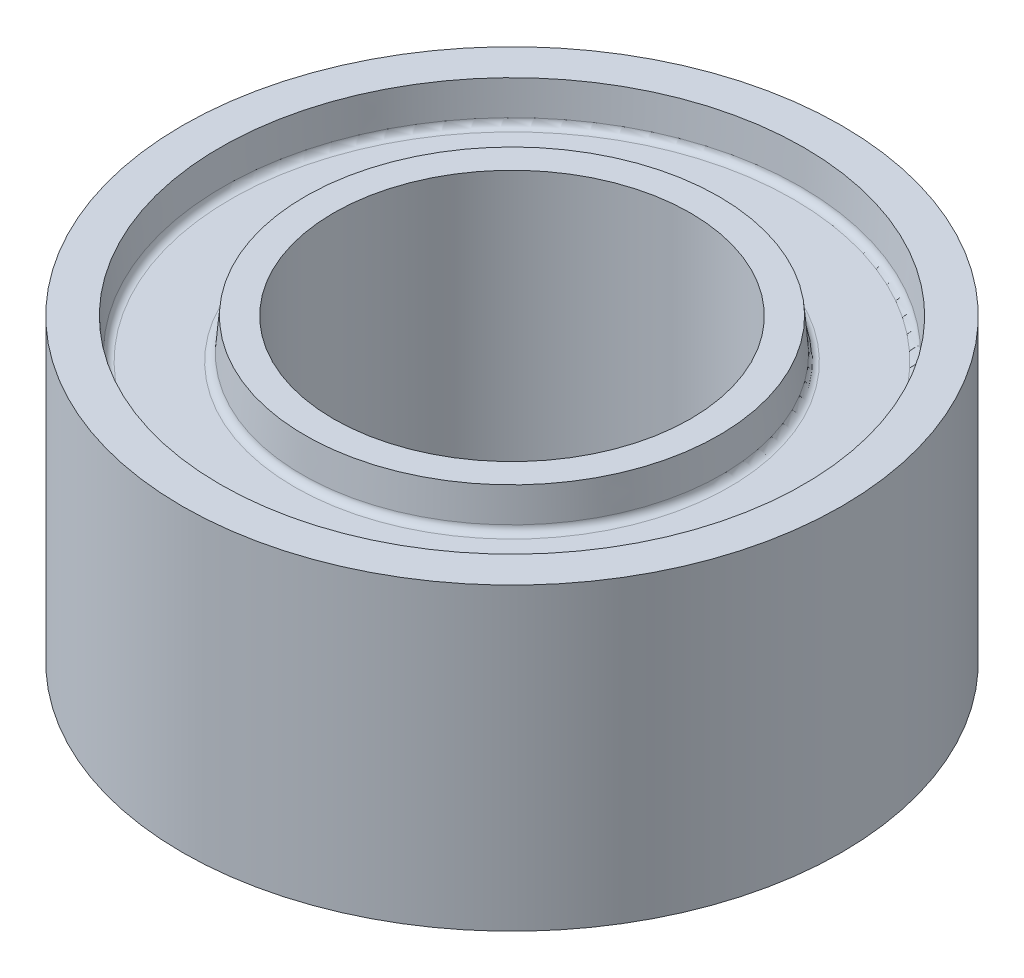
ISO-10303-21;
HEADER;
FILE_DESCRIPTION(('STEP AP214'),'2;1');
FILE_NAME('part.step','',(''),(''),'','','');
FILE_SCHEMA(('AUTOMOTIVE_DESIGN { 1 0 10303 214 1 1 1 1 }'));
ENDSEC;
DATA;
#1=APPLICATION_CONTEXT('core data for automotive mechanical design processes');
#2=APPLICATION_PROTOCOL_DEFINITION('international standard','automotive_design',2000,#1);
#3=PRODUCT_CONTEXT('',#1,'mechanical');
#4=PRODUCT('Part','Part','',(#3));
#5=PRODUCT_RELATED_PRODUCT_CATEGORY('part','',(#4));
#6=PRODUCT_DEFINITION_FORMATION('','',#4);
#7=PRODUCT_DEFINITION_CONTEXT('part definition',#1,'design');
#8=PRODUCT_DEFINITION('design','',#6,#7);
#9=PRODUCT_DEFINITION_SHAPE('','',#8);
#10=(LENGTH_UNIT() NAMED_UNIT(*) SI_UNIT(.MILLI.,.METRE.));
#11=(NAMED_UNIT(*) PLANE_ANGLE_UNIT() SI_UNIT($,.RADIAN.));
#12=(NAMED_UNIT(*) SI_UNIT($,.STERADIAN.) SOLID_ANGLE_UNIT());
#13=UNCERTAINTY_MEASURE_WITH_UNIT(LENGTH_MEASURE(1.E-05),#10,'distance_accuracy_value','');
#14=(GEOMETRIC_REPRESENTATION_CONTEXT(3) GLOBAL_UNCERTAINTY_ASSIGNED_CONTEXT((#13)) GLOBAL_UNIT_ASSIGNED_CONTEXT((#10,
#11,#12)) REPRESENTATION_CONTEXT('',''));
#15=CARTESIAN_POINT('',(0.,0.,0.));
#16=DIRECTION('',(0.,0.,1.));
#17=DIRECTION('',(1.,0.,0.));
#18=AXIS2_PLACEMENT_3D('',#15,#16,#17);
#19=CARTESIAN_POINT('',(0.,10.,0.));
#20=DIRECTION('',(0.,1.,0.));
#21=DIRECTION('',(0.,0.,1.));
#22=AXIS2_PLACEMENT_3D('',#19,#20,#21);
#23=PLANE('',#22);
#24=CARTESIAN_POINT('',(0.,10.,0.));
#25=DIRECTION('',(0.,-1.,0.));
#26=DIRECTION('',(0.,0.,-1.));
#27=AXIS2_PLACEMENT_3D('',#24,#25,#26);
#28=CIRCLE('',#27,6.90243030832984);
#29=CARTESIAN_POINT('',(0.,10.,-6.90243030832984));
#30=VERTEX_POINT('',#29);
#31=EDGE_CURVE('E72',#30,#30,#28,.T.);
#32=ORIENTED_EDGE('',*,*,#31,.F.);
#33=EDGE_LOOP('',(#32));
#34=FACE_BOUND('',#33,.T.);
#35=CARTESIAN_POINT('',(0.,10.,0.));
#36=DIRECTION('',(0.,1.,0.));
#37=DIRECTION('',(0.,0.,1.));
#38=AXIS2_PLACEMENT_3D('',#35,#36,#37);
#39=CIRCLE('',#38,5.95249);
#40=CARTESIAN_POINT('',(0.,10.,5.95249));
#41=VERTEX_POINT('',#40);
#42=EDGE_CURVE('E59',#41,#41,#39,.T.);
#43=ORIENTED_EDGE('',*,*,#42,.F.);
#44=EDGE_LOOP('',(#43));
#45=FACE_BOUND('',#44,.T.);
#46=ADVANCED_FACE('F44',(#34,#45),#23,.T.);
#47=CARTESIAN_POINT('',(0.,10.,0.));
#48=DIRECTION('',(0.,-1.,0.));
#49=DIRECTION('',(0.,0.,-1.));
#50=AXIS2_PLACEMENT_3D('',#47,#48,#49);
#51=CIRCLE('',#50,9.73456969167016);
#52=CARTESIAN_POINT('',(0.,10.,-9.73456969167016));
#53=VERTEX_POINT('',#52);
#54=EDGE_CURVE('E76',#53,#53,#51,.T.);
#55=ORIENTED_EDGE('',*,*,#54,.T.);
#56=EDGE_LOOP('',(#55));
#57=FACE_BOUND('',#56,.T.);
#58=CARTESIAN_POINT('',(0.,10.,0.));
#59=DIRECTION('',(0.,1.,0.));
#60=DIRECTION('',(0.,0.,1.));
#61=AXIS2_PLACEMENT_3D('',#58,#59,#60);
#62=CIRCLE('',#61,10.9985226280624);
#63=CARTESIAN_POINT('',(0.,10.,10.9985226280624));
#64=VERTEX_POINT('',#63);
#65=EDGE_CURVE('E10',#64,#64,#62,.T.);
#66=ORIENTED_EDGE('',*,*,#65,.T.);
#67=EDGE_LOOP('',(#66));
#68=FACE_BOUND('',#67,.T.);
#69=ADVANCED_FACE('F113',(#57,#68),#23,.T.);
#70=CARTESIAN_POINT('',(0.,0.,0.));
#71=DIRECTION('',(0.,1.,0.));
#72=DIRECTION('',(0.,0.,1.));
#73=AXIS2_PLACEMENT_3D('',#70,#71,#72);
#74=PLANE('',#73);
#75=CARTESIAN_POINT('',(0.,0.,0.));
#76=DIRECTION('',(0.,1.,0.));
#77=DIRECTION('',(0.,0.,1.));
#78=AXIS2_PLACEMENT_3D('',#75,#76,#77);
#79=CIRCLE('',#78,10.9985226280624);
#80=CARTESIAN_POINT('',(0.,0.,10.9985226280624));
#81=VERTEX_POINT('',#80);
#82=EDGE_CURVE('E48',#81,#81,#79,.T.);
#83=ORIENTED_EDGE('',*,*,#82,.F.);
#84=EDGE_LOOP('',(#83));
#85=FACE_BOUND('',#84,.T.);
#86=CARTESIAN_POINT('',(0.,0.,0.));
#87=DIRECTION('',(0.,1.,0.));
#88=DIRECTION('',(0.,0.,1.));
#89=AXIS2_PLACEMENT_3D('',#86,#87,#88);
#90=CIRCLE('',#89,5.95249);
#91=CARTESIAN_POINT('',(0.,0.,5.95249));
#92=VERTEX_POINT('',#91);
#93=EDGE_CURVE('E61',#92,#92,#90,.T.);
#94=ORIENTED_EDGE('',*,*,#93,.T.);
#95=EDGE_LOOP('',(#94));
#96=FACE_BOUND('',#95,.T.);
#97=ADVANCED_FACE('F122',(#85,#96),#74,.F.);
#98=CARTESIAN_POINT('',(0.,10.,0.));
#99=DIRECTION('',(0.,-1.,0.));
#100=DIRECTION('',(0.,0.,-1.));
#101=AXIS2_PLACEMENT_3D('',#98,#99,#100);
#102=CYLINDRICAL_SURFACE('',#101,10.9985226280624);
#103=ORIENTED_EDGE('',*,*,#65,.F.);
#104=EDGE_LOOP('',(#103));
#105=FACE_BOUND('',#104,.T.);
#106=ORIENTED_EDGE('',*,*,#82,.T.);
#107=EDGE_LOOP('',(#106));
#108=FACE_BOUND('',#107,.T.);
#109=ADVANCED_FACE('F46',(#105,#108),#102,.T.);
#110=CARTESIAN_POINT('',(0.,10.,0.));
#111=DIRECTION('',(0.,-1.,0.));
#112=DIRECTION('',(0.,0.,-1.));
#113=AXIS2_PLACEMENT_3D('',#110,#111,#112);
#114=CYLINDRICAL_SURFACE('',#113,5.95249);
#115=ORIENTED_EDGE('',*,*,#42,.T.);
#116=EDGE_LOOP('',(#115));
#117=FACE_BOUND('',#116,.T.);
#118=ORIENTED_EDGE('',*,*,#93,.F.);
#119=EDGE_LOOP('',(#118));
#120=FACE_BOUND('',#119,.T.);
#121=ADVANCED_FACE('F101',(#117,#120),#114,.F.);
#122=CARTESIAN_POINT('',(0.,8.9332,0.));
#123=DIRECTION('',(0.,-1.,0.));
#124=DIRECTION('',(0.,0.,-1.));
#125=AXIS2_PLACEMENT_3D('',#122,#123,#124);
#126=TOROIDAL_SURFACE('',#125,7.2507334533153,0.254);
#127=CARTESIAN_POINT('',(0.,8.6792,0.));
#128=DIRECTION('',(0.,-1.,0.));
#129=DIRECTION('',(0.,0.,-1.));
#130=AXIS2_PLACEMENT_3D('',#127,#128,#129);
#131=CIRCLE('',#130,7.2507334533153);
#132=CARTESIAN_POINT('',(0.,8.6792,-7.2507334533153));
#133=VERTEX_POINT('',#132);
#134=EDGE_CURVE('E88',#133,#133,#131,.T.);
#135=ORIENTED_EDGE('',*,*,#134,.F.);
#136=EDGE_LOOP('',(#135));
#137=FACE_BOUND('',#136,.T.);
#138=CARTESIAN_POINT('',(0.,8.91106244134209,0.));
#139=DIRECTION('',(0.,-1.,0.));
#140=DIRECTION('',(0.,0.,-1.));
#141=AXIS2_PLACEMENT_3D('',#138,#139,#140);
#142=CIRCLE('',#141,6.9977);
#143=CARTESIAN_POINT('',(0.,8.91106244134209,-6.9977));
#144=VERTEX_POINT('',#143);
#145=EDGE_CURVE('E65',#144,#144,#142,.T.);
#146=ORIENTED_EDGE('',*,*,#145,.T.);
#147=EDGE_LOOP('',(#146));
#148=FACE_BOUND('',#147,.T.);
#149=ADVANCED_FACE('F97',(#137,#148),#126,.F.);
#150=CARTESIAN_POINT('',(0.,10.,0.));
#151=DIRECTION('',(0.,-1.,0.));
#152=DIRECTION('',(0.,0.,-1.));
#153=AXIS2_PLACEMENT_3D('',#150,#151,#152);
#154=CONICAL_SURFACE('',#153,6.90243030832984,0.0872664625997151);
#155=ORIENTED_EDGE('',*,*,#145,.F.);
#156=EDGE_LOOP('',(#155));
#157=FACE_BOUND('',#156,.T.);
#158=ORIENTED_EDGE('',*,*,#31,.T.);
#159=EDGE_LOOP('',(#158));
#160=FACE_BOUND('',#159,.T.);
#161=ADVANCED_FACE('F100',(#157,#160),#154,.T.);
#162=CARTESIAN_POINT('',(0.,8.91106244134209,0.));
#163=DIRECTION('',(0.,1.,0.));
#164=DIRECTION('',(0.,0.,1.));
#165=AXIS2_PLACEMENT_3D('',#162,#163,#164);
#166=CONICAL_SURFACE('',#165,9.6393,0.0872664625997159);
#167=ORIENTED_EDGE('',*,*,#54,.F.);
#168=EDGE_LOOP('',(#167));
#169=FACE_BOUND('',#168,.T.);
#170=CARTESIAN_POINT('',(0.,8.91106244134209,0.));
#171=DIRECTION('',(0.,-1.,0.));
#172=DIRECTION('',(0.,0.,-1.));
#173=AXIS2_PLACEMENT_3D('',#170,#171,#172);
#174=CIRCLE('',#173,9.6393);
#175=CARTESIAN_POINT('',(0.,8.91106244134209,-9.6393));
#176=VERTEX_POINT('',#175);
#177=EDGE_CURVE('E80',#176,#176,#174,.T.);
#178=ORIENTED_EDGE('',*,*,#177,.T.);
#179=EDGE_LOOP('',(#178));
#180=FACE_BOUND('',#179,.T.);
#181=ADVANCED_FACE('F107',(#169,#180),#166,.F.);
#182=CARTESIAN_POINT('',(0.,8.9332,0.));
#183=DIRECTION('',(0.,-1.,0.));
#184=DIRECTION('',(0.,0.,-1.));
#185=AXIS2_PLACEMENT_3D('',#182,#183,#184);
#186=TOROIDAL_SURFACE('',#185,9.3862665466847,0.254);
#187=ORIENTED_EDGE('',*,*,#177,.F.);
#188=EDGE_LOOP('',(#187));
#189=FACE_BOUND('',#188,.T.);
#190=CARTESIAN_POINT('',(0.,8.6792,0.));
#191=DIRECTION('',(0.,-1.,0.));
#192=DIRECTION('',(0.,0.,-1.));
#193=AXIS2_PLACEMENT_3D('',#190,#191,#192);
#194=CIRCLE('',#193,9.3862665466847);
#195=CARTESIAN_POINT('',(0.,8.6792,-9.3862665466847));
#196=VERTEX_POINT('',#195);
#197=EDGE_CURVE('E84',#196,#196,#194,.T.);
#198=ORIENTED_EDGE('',*,*,#197,.T.);
#199=EDGE_LOOP('',(#198));
#200=FACE_BOUND('',#199,.T.);
#201=ADVANCED_FACE('F135',(#189,#200),#186,.F.);
#202=CARTESIAN_POINT('',(0.,8.6792,9.3862665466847));
#203=DIRECTION('',(0.,-1.,0.));
#204=DIRECTION('',(0.,0.,-1.));
#205=AXIS2_PLACEMENT_3D('',#202,#203,#204);
#206=PLANE('',#205);
#207=ORIENTED_EDGE('',*,*,#197,.F.);
#208=EDGE_LOOP('',(#207));
#209=FACE_BOUND('',#208,.T.);
#210=ORIENTED_EDGE('',*,*,#134,.T.);
#211=EDGE_LOOP('',(#210));
#212=FACE_BOUND('',#211,.T.);
#213=ADVANCED_FACE('F95',(#209,#212),#206,.F.);
#214=CLOSED_SHELL('',(#46,#69,#97,#109,#121,#149,#161,#181,#201,#213));
#215=MANIFOLD_SOLID_BREP('B2',#214);
#216=ADVANCED_BREP_SHAPE_REPRESENTATION('',(#18,#215),#14);
#217=SHAPE_DEFINITION_REPRESENTATION(#9,#216);
ENDSEC;
END-ISO-10303-21;
